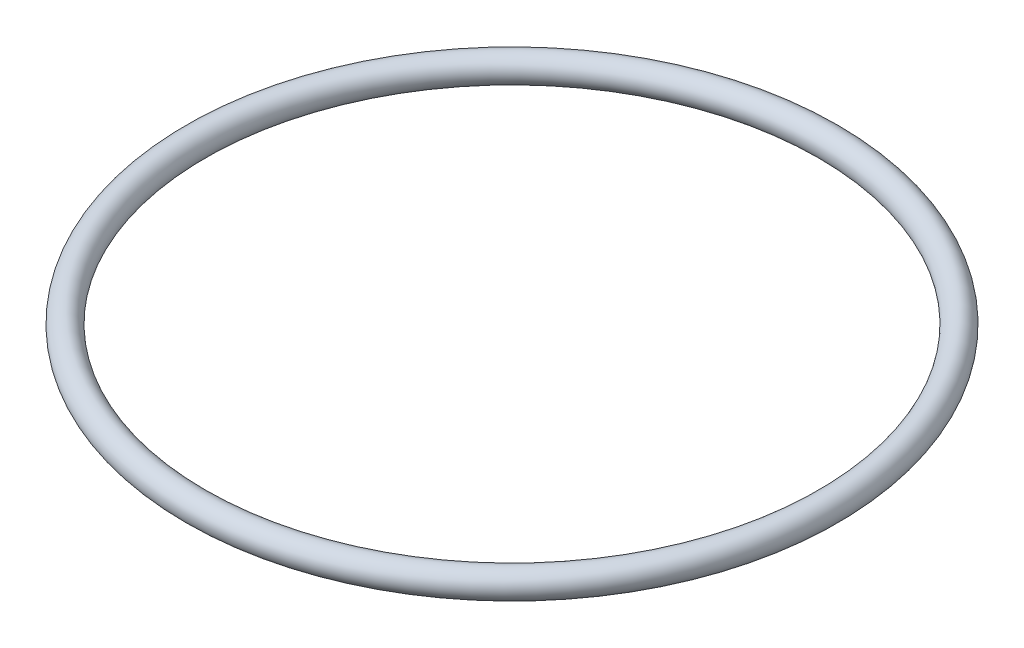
from build123d import *

# Parameters (mm, degrees)
SKETCH1_R = 2.667


with BuildPart() as part:
    # Sketch1 → Revolve1 (revolve)
    with BuildSketch(Plane.XY, mode=Mode.PRIVATE) as revolve1_sk:
        with Locations((-62.6745, 0)):
            Circle(SKETCH1_R)
    revolve(revolve1_sk.sketch.rotate(Axis((0, 0, 0), (0, 1, 0)), 270), axis=Axis((0, 0, 0), (0, 1, 0)))


solid = part.part
